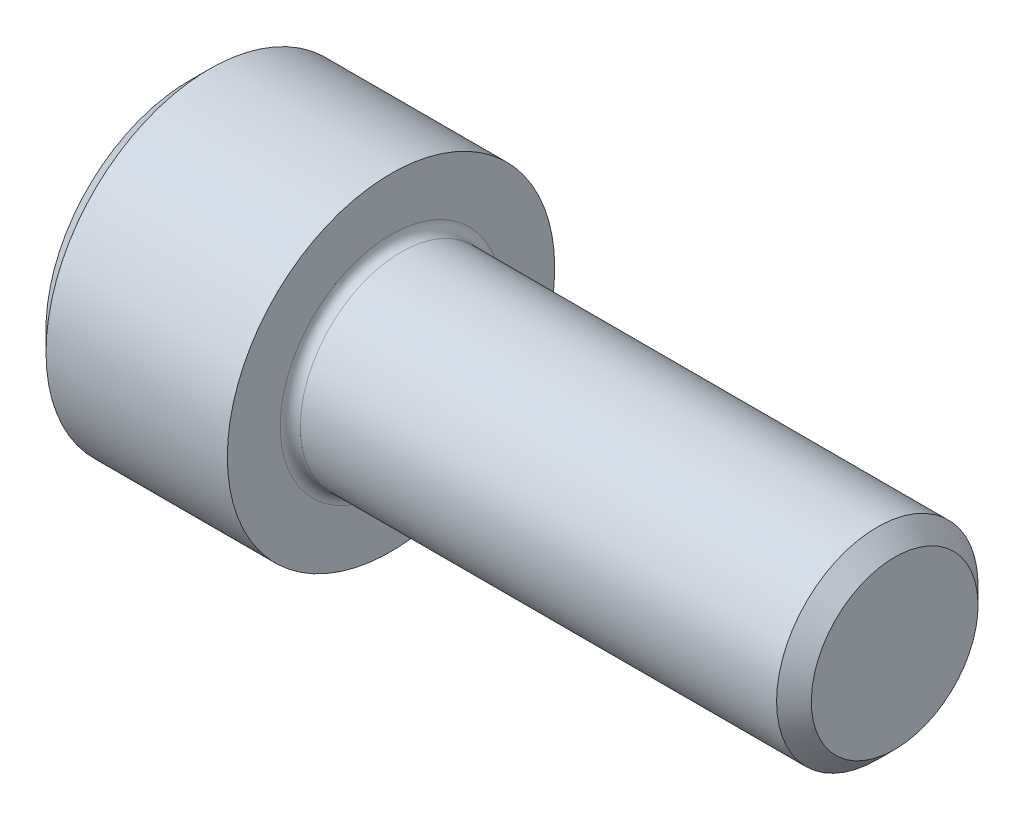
ISO-10303-21;
HEADER;
FILE_DESCRIPTION(('STEP AP214'),'2;1');
FILE_NAME('part.step','',(''),(''),'','','');
FILE_SCHEMA(('AUTOMOTIVE_DESIGN { 1 0 10303 214 1 1 1 1 }'));
ENDSEC;
DATA;
#1=APPLICATION_CONTEXT('core data for automotive mechanical design processes');
#2=APPLICATION_PROTOCOL_DEFINITION('international standard','automotive_design',2000,#1);
#3=PRODUCT_CONTEXT('',#1,'mechanical');
#4=PRODUCT('Part','Part','',(#3));
#5=PRODUCT_RELATED_PRODUCT_CATEGORY('part','',(#4));
#6=PRODUCT_DEFINITION_FORMATION('','',#4);
#7=PRODUCT_DEFINITION_CONTEXT('part definition',#1,'design');
#8=PRODUCT_DEFINITION('design','',#6,#7);
#9=PRODUCT_DEFINITION_SHAPE('','',#8);
#10=(LENGTH_UNIT() NAMED_UNIT(*) SI_UNIT(.MILLI.,.METRE.));
#11=(NAMED_UNIT(*) PLANE_ANGLE_UNIT() SI_UNIT($,.RADIAN.));
#12=(NAMED_UNIT(*) SI_UNIT($,.STERADIAN.) SOLID_ANGLE_UNIT());
#13=UNCERTAINTY_MEASURE_WITH_UNIT(LENGTH_MEASURE(1.E-05),#10,'distance_accuracy_value','');
#14=(GEOMETRIC_REPRESENTATION_CONTEXT(3) GLOBAL_UNCERTAINTY_ASSIGNED_CONTEXT((#13)) GLOBAL_UNIT_ASSIGNED_CONTEXT((#10,
#11,#12)) REPRESENTATION_CONTEXT('',''));
#15=CARTESIAN_POINT('',(0.,0.,0.));
#16=DIRECTION('',(0.,0.,1.));
#17=DIRECTION('',(1.,0.,0.));
#18=AXIS2_PLACEMENT_3D('',#15,#16,#17);
#19=CARTESIAN_POINT('',(28.,-3.349214,3.349214));
#20=DIRECTION('',(1.,0.,0.));
#21=DIRECTION('',(0.,0.,-1.));
#22=AXIS2_PLACEMENT_3D('',#19,#20,#21);
#23=PLANE('',#22);
#24=CARTESIAN_POINT('',(28.,0.,0.));
#25=DIRECTION('',(-1.,0.,0.));
#26=DIRECTION('',(0.,-1.,0.));
#27=AXIS2_PLACEMENT_3D('',#24,#25,#26);
#28=CIRCLE('',#27,3.30949999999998);
#29=CARTESIAN_POINT('',(28.,-3.30949999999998,0.));
#30=VERTEX_POINT('',#29);
#31=EDGE_CURVE('E21',#30,#30,#28,.F.);
#32=ORIENTED_EDGE('',*,*,#31,.T.);
#33=EDGE_LOOP('',(#32));
#34=FACE_BOUND('',#33,.T.);
#35=ADVANCED_FACE('F17',(#34),#23,.T.);
#36=CARTESIAN_POINT('',(28.,0.,0.));
#37=DIRECTION('',(-1.,0.,0.));
#38=DIRECTION('',(0.,-1.,0.));
#39=AXIS2_PLACEMENT_3D('',#36,#37,#38);
#40=CONICAL_SURFACE('',#39,3.3095,0.785398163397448);
#41=CARTESIAN_POINT('',(27.3095,0.,0.));
#42=DIRECTION('',(-1.,0.,0.));
#43=DIRECTION('',(0.,0.,1.));
#44=AXIS2_PLACEMENT_3D('',#41,#42,#43);
#45=CIRCLE('',#44,4.);
#46=CARTESIAN_POINT('',(27.3095,0.,4.));
#47=VERTEX_POINT('',#46);
#48=EDGE_CURVE('E125',#47,#47,#45,.F.);
#49=ORIENTED_EDGE('',*,*,#48,.T.);
#50=EDGE_LOOP('',(#49));
#51=FACE_BOUND('',#50,.T.);
#52=ORIENTED_EDGE('',*,*,#31,.F.);
#53=EDGE_LOOP('',(#52));
#54=FACE_BOUND('',#53,.T.);
#55=ADVANCED_FACE('F255',(#51,#54),#40,.T.);
#56=CARTESIAN_POINT('',(27.3095,0.,0.));
#57=DIRECTION('',(-1.,0.,0.));
#58=DIRECTION('',(0.,-1.,0.));
#59=AXIS2_PLACEMENT_3D('',#56,#57,#58);
#60=CYLINDRICAL_SURFACE('',#59,4.);
#61=CARTESIAN_POINT('',(8.40000000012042,0.,0.));
#62=DIRECTION('',(1.,0.,0.));
#63=DIRECTION('',(0.,0.,-1.));
#64=AXIS2_PLACEMENT_3D('',#61,#62,#63);
#65=CIRCLE('',#64,4.00000000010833);
#66=CARTESIAN_POINT('',(8.40000000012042,0.,-4.00000000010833));
#67=VERTEX_POINT('',#66);
#68=EDGE_CURVE('E121',#67,#67,#65,.T.);
#69=ORIENTED_EDGE('',*,*,#68,.T.);
#70=EDGE_LOOP('',(#69));
#71=FACE_BOUND('',#70,.T.);
#72=ORIENTED_EDGE('',*,*,#48,.F.);
#73=EDGE_LOOP('',(#72));
#74=FACE_BOUND('',#73,.T.);
#75=ADVANCED_FACE('F251',(#71,#74),#60,.T.);
#76=CARTESIAN_POINT('',(8.40000000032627,0.,0.));
#77=DIRECTION('',(1.,0.,0.));
#78=DIRECTION('',(0.,0.,-1.));
#79=AXIS2_PLACEMENT_3D('',#76,#77,#78);
#80=TOROIDAL_SURFACE('',#79,4.40000000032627,0.400000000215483);
#81=ORIENTED_EDGE('',*,*,#68,.F.);
#82=EDGE_LOOP('',(#81));
#83=FACE_BOUND('',#82,.T.);
#84=CARTESIAN_POINT('',(8.00000000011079,0.,0.));
#85=DIRECTION('',(1.,0.,0.));
#86=DIRECTION('',(0.,0.,-1.));
#87=AXIS2_PLACEMENT_3D('',#84,#85,#86);
#88=CIRCLE('',#87,4.400000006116);
#89=CARTESIAN_POINT('',(8.00000000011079,0.,-4.400000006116));
#90=VERTEX_POINT('',#89);
#91=EDGE_CURVE('E119',#90,#90,#88,.F.);
#92=ORIENTED_EDGE('',*,*,#91,.F.);
#93=EDGE_LOOP('',(#92));
#94=FACE_BOUND('',#93,.T.);
#95=ADVANCED_FACE('F254',(#83,#94),#80,.F.);
#96=CARTESIAN_POINT('',(8.,-6.578,6.578));
#97=DIRECTION('',(1.,0.,0.));
#98=DIRECTION('',(0.,0.,-1.));
#99=AXIS2_PLACEMENT_3D('',#96,#97,#98);
#100=PLANE('',#99);
#101=ORIENTED_EDGE('',*,*,#91,.T.);
#102=EDGE_LOOP('',(#101));
#103=FACE_BOUND('',#102,.T.);
#104=CARTESIAN_POINT('',(8.,0.,0.));
#105=DIRECTION('',(-1.,0.,0.));
#106=DIRECTION('',(0.,0.,1.));
#107=AXIS2_PLACEMENT_3D('',#104,#105,#106);
#108=CIRCLE('',#107,6.5);
#109=CARTESIAN_POINT('',(8.,0.,6.5));
#110=VERTEX_POINT('',#109);
#111=EDGE_CURVE('E117',#110,#110,#108,.F.);
#112=ORIENTED_EDGE('',*,*,#111,.T.);
#113=EDGE_LOOP('',(#112));
#114=FACE_BOUND('',#113,.T.);
#115=ADVANCED_FACE('F249',(#103,#114),#100,.T.);
#116=CARTESIAN_POINT('',(8.,0.,0.));
#117=DIRECTION('',(-1.,0.,0.));
#118=DIRECTION('',(0.,0.,1.));
#119=AXIS2_PLACEMENT_3D('',#116,#117,#118);
#120=CYLINDRICAL_SURFACE('',#119,6.5);
#121=CARTESIAN_POINT('',(0.799999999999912,0.,0.));
#122=DIRECTION('',(1.,0.,0.));
#123=DIRECTION('',(0.,0.,-1.));
#124=AXIS2_PLACEMENT_3D('',#121,#122,#123);
#125=CIRCLE('',#124,6.5);
#126=CARTESIAN_POINT('',(0.8,0.,-6.5));
#127=VERTEX_POINT('',#126);
#128=EDGE_CURVE('E94',#127,#127,#125,.T.);
#129=ORIENTED_EDGE('',*,*,#128,.T.);
#130=EDGE_LOOP('',(#129));
#131=FACE_BOUND('',#130,.T.);
#132=ORIENTED_EDGE('',*,*,#111,.F.);
#133=EDGE_LOOP('',(#132));
#134=FACE_BOUND('',#133,.T.);
#135=ADVANCED_FACE('F245',(#131,#134),#120,.T.);
#136=CARTESIAN_POINT('',(0.,0.,0.));
#137=DIRECTION('',(1.,0.,0.));
#138=DIRECTION('',(0.,0.,-1.));
#139=AXIS2_PLACEMENT_3D('',#136,#137,#138);
#140=CONICAL_SURFACE('',#139,5.7,0.785398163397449);
#141=ORIENTED_EDGE('',*,*,#128,.F.);
#142=EDGE_LOOP('',(#141));
#143=FACE_BOUND('',#142,.T.);
#144=CARTESIAN_POINT('',(0.,0.,0.));
#145=DIRECTION('',(1.,0.,0.));
#146=DIRECTION('',(0.,0.,-1.));
#147=AXIS2_PLACEMENT_3D('',#144,#145,#146);
#148=CIRCLE('',#147,5.7);
#149=CARTESIAN_POINT('',(0.,0.,-5.7));
#150=VERTEX_POINT('',#149);
#151=EDGE_CURVE('E93',#150,#150,#148,.F.);
#152=ORIENTED_EDGE('',*,*,#151,.F.);
#153=EDGE_LOOP('',(#152));
#154=FACE_BOUND('',#153,.T.);
#155=ADVANCED_FACE('F242',(#143,#154),#140,.T.);
#156=CARTESIAN_POINT('',(0.,1.759474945,-3.0475));
#157=DIRECTION('',(0.,0.866025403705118,-0.500000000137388));
#158=DIRECTION('',(0.,0.500000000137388,0.866025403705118));
#159=AXIS2_PLACEMENT_3D('',#156,#157,#158);
#160=PLANE('',#159);
#161=DIRECTION('',(1.,0.,0.));
#162=VECTOR('',#161,1.);
#163=CARTESIAN_POINT('',(2.,1.759474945,-3.0475));
#164=LINE('',#163,#162);
#165=CARTESIAN_POINT('',(0.,1.75947494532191,-3.0475));
#166=VERTEX_POINT('',#165);
#167=CARTESIAN_POINT('',(4.,1.759474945,-3.0475));
#168=VERTEX_POINT('',#167);
#169=EDGE_CURVE('E160',#166,#168,#164,.T.);
#170=ORIENTED_EDGE('',*,*,#169,.T.);
#171=DIRECTION('',(0.,0.500000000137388,0.866025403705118));
#172=VECTOR('',#171,1.);
#173=CARTESIAN_POINT('',(4.,1.759474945,-3.0475));
#174=LINE('',#173,#172);
#175=CARTESIAN_POINT('',(4.,2.63921241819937,-1.52374999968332));
#176=VERTEX_POINT('',#175);
#177=EDGE_CURVE('E158',#168,#176,#174,.T.);
#178=ORIENTED_EDGE('',*,*,#177,.T.);
#179=DIRECTION('',(0.,0.500000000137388,0.866025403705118));
#180=VECTOR('',#179,1.);
#181=CARTESIAN_POINT('',(4.,1.759474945,-3.0475));
#182=LINE('',#181,#180);
#183=CARTESIAN_POINT('',(4.,3.518949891,0.));
#184=VERTEX_POINT('',#183);
#185=EDGE_CURVE('E88',#176,#184,#182,.T.);
#186=ORIENTED_EDGE('',*,*,#185,.T.);
#187=DIRECTION('',(1.,0.,0.));
#188=VECTOR('',#187,1.);
#189=CARTESIAN_POINT('',(2.,3.518949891,0.));
#190=LINE('',#189,#188);
#191=CARTESIAN_POINT('',(0.,3.5189498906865,-4.93629063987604E-11));
#192=VERTEX_POINT('',#191);
#193=EDGE_CURVE('E81',#192,#184,#190,.T.);
#194=ORIENTED_EDGE('',*,*,#193,.F.);
#195=DIRECTION('',(0.,0.499999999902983,0.866025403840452));
#196=VECTOR('',#195,1.);
#197=CARTESIAN_POINT('',(0.,1.759474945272,-3.047500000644));
#198=LINE('',#197,#196);
#199=EDGE_CURVE('E85',#166,#192,#198,.T.);
#200=ORIENTED_EDGE('',*,*,#199,.F.);
#201=EDGE_LOOP('',(#170,#178,#186,#194,#200));
#202=FACE_BOUND('',#201,.T.);
#203=ADVANCED_FACE('F84',(#202),#160,.F.);
#204=CARTESIAN_POINT('',(0.,1.759474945,3.0475));
#205=DIRECTION('',(0.,-0.866025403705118,-0.500000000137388));
#206=DIRECTION('',(0.,0.500000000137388,-0.866025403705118));
#207=AXIS2_PLACEMENT_3D('',#204,#205,#206);
#208=PLANE('',#207);
#209=DIRECTION('',(0.,0.500000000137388,-0.866025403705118));
#210=VECTOR('',#209,1.);
#211=CARTESIAN_POINT('',(4.,1.759474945,3.0475));
#212=LINE('',#211,#210);
#213=CARTESIAN_POINT('',(4.,2.63921241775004,1.52375000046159));
#214=VERTEX_POINT('',#213);
#215=CARTESIAN_POINT('',(4.,1.759474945,3.0475));
#216=VERTEX_POINT('',#215);
#217=EDGE_CURVE('E106',#214,#216,#212,.F.);
#218=ORIENTED_EDGE('',*,*,#217,.T.);
#219=DIRECTION('',(-1.,0.,0.));
#220=VECTOR('',#219,1.);
#221=CARTESIAN_POINT('',(2.,1.759474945,3.0475));
#222=LINE('',#221,#220);
#223=CARTESIAN_POINT('',(0.,1.75947494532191,3.0475));
#224=VERTEX_POINT('',#223);
#225=EDGE_CURVE('E111',#216,#224,#222,.T.);
#226=ORIENTED_EDGE('',*,*,#225,.T.);
#227=DIRECTION('',(0.,-0.499999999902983,0.866025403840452));
#228=VECTOR('',#227,1.);
#229=CARTESIAN_POINT('',(0.,3.518949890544,0.));
#230=LINE('',#229,#228);
#231=EDGE_CURVE('E101',#192,#224,#230,.T.);
#232=ORIENTED_EDGE('',*,*,#231,.F.);
#233=ORIENTED_EDGE('',*,*,#193,.T.);
#234=DIRECTION('',(0.,0.500000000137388,-0.866025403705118));
#235=VECTOR('',#234,1.);
#236=CARTESIAN_POINT('',(4.,1.759474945,3.0475));
#237=LINE('',#236,#235);
#238=EDGE_CURVE('E161',#184,#214,#237,.F.);
#239=ORIENTED_EDGE('',*,*,#238,.T.);
#240=EDGE_LOOP('',(#218,#226,#232,#233,#239));
#241=FACE_BOUND('',#240,.T.);
#242=ADVANCED_FACE('F109',(#241),#208,.T.);
#243=CARTESIAN_POINT('',(0.,-5.7684,-5.7684));
#244=DIRECTION('',(-1.,0.,0.));
#245=DIRECTION('',(0.,0.,1.));
#246=AXIS2_PLACEMENT_3D('',#243,#244,#245);
#247=PLANE('',#246);
#248=DIRECTION('',(0.,1.,0.));
#249=VECTOR('',#248,1.);
#250=CARTESIAN_POINT('',(0.,0.,-3.0475));
#251=LINE('',#250,#249);
#252=CARTESIAN_POINT('',(0.,-1.759474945,-3.0475));
#253=VERTEX_POINT('',#252);
#254=EDGE_CURVE('E105',#253,#166,#251,.T.);
#255=ORIENTED_EDGE('',*,*,#254,.T.);
#256=ORIENTED_EDGE('',*,*,#199,.T.);
#257=ORIENTED_EDGE('',*,*,#231,.T.);
#258=DIRECTION('',(0.,-1.,0.));
#259=VECTOR('',#258,1.);
#260=CARTESIAN_POINT('',(0.,0.,3.0475));
#261=LINE('',#260,#259);
#262=CARTESIAN_POINT('',(0.,-1.759474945,3.0475));
#263=VERTEX_POINT('',#262);
#264=EDGE_CURVE('E173',#224,#263,#261,.T.);
#265=ORIENTED_EDGE('',*,*,#264,.T.);
#266=DIRECTION('',(0.,0.500000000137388,0.866025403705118));
#267=VECTOR('',#266,1.);
#268=CARTESIAN_POINT('',(0.,-2.639212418,1.52375));
#269=LINE('',#268,#267);
#270=CARTESIAN_POINT('',(0.,-3.518949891,0.));
#271=VERTEX_POINT('',#270);
#272=EDGE_CURVE('E199',#271,#263,#269,.T.);
#273=ORIENTED_EDGE('',*,*,#272,.F.);
#274=DIRECTION('',(0.,-0.500000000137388,0.866025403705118));
#275=VECTOR('',#274,1.);
#276=CARTESIAN_POINT('',(0.,-2.639212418,-1.52375));
#277=LINE('',#276,#275);
#278=EDGE_CURVE('E179',#253,#271,#277,.T.);
#279=ORIENTED_EDGE('',*,*,#278,.F.);
#280=EDGE_LOOP('',(#255,#256,#257,#265,#273,#279));
#281=FACE_BOUND('',#280,.T.);
#282=ORIENTED_EDGE('',*,*,#151,.T.);
#283=EDGE_LOOP('',(#282));
#284=FACE_BOUND('',#283,.T.);
#285=ADVANCED_FACE('F98',(#281,#284),#247,.T.);
#286=CARTESIAN_POINT('',(4.,-0.015835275,3.0475));
#287=DIRECTION('',(1.,0.,0.));
#288=DIRECTION('',(0.,0.,-1.));
#289=AXIS2_PLACEMENT_3D('',#286,#287,#288);
#290=PLANE('',#289);
#291=ORIENTED_EDGE('',*,*,#217,.F.);
#292=CARTESIAN_POINT('',(4.,0.,0.));
#293=DIRECTION('',(-1.,0.,0.));
#294=DIRECTION('',(0.,0.,1.));
#295=AXIS2_PLACEMENT_3D('',#292,#293,#294);
#296=CIRCLE('',#295,3.0475);
#297=CARTESIAN_POINT('',(4.,-2.73646157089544E-10,3.0475));
#298=VERTEX_POINT('',#297);
#299=EDGE_CURVE('E154',#298,#214,#296,.T.);
#300=ORIENTED_EDGE('',*,*,#299,.F.);
#301=DIRECTION('',(0.,1.,0.));
#302=VECTOR('',#301,1.);
#303=CARTESIAN_POINT('',(4.,0.,3.0475));
#304=LINE('',#303,#302);
#305=EDGE_CURVE('E170',#298,#216,#304,.T.);
#306=ORIENTED_EDGE('',*,*,#305,.T.);
#307=EDGE_LOOP('',(#291,#300,#306));
#308=FACE_BOUND('',#307,.T.);
#309=ADVANCED_FACE('F175',(#308),#290,.F.);
#310=CARTESIAN_POINT('',(4.,2.633933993,1.542035));
#311=DIRECTION('',(1.,0.,0.));
#312=DIRECTION('',(0.,0.,-1.));
#313=AXIS2_PLACEMENT_3D('',#310,#311,#312);
#314=PLANE('',#313);
#315=ORIENTED_EDGE('',*,*,#185,.F.);
#316=CARTESIAN_POINT('',(4.,0.,0.));
#317=DIRECTION('',(-1.,0.,0.));
#318=DIRECTION('',(0.,0.,1.));
#319=AXIS2_PLACEMENT_3D('',#316,#317,#318);
#320=CIRCLE('',#319,3.0475);
#321=EDGE_CURVE('E151',#214,#176,#320,.T.);
#322=ORIENTED_EDGE('',*,*,#321,.F.);
#323=ORIENTED_EDGE('',*,*,#238,.F.);
#324=EDGE_LOOP('',(#315,#322,#323));
#325=FACE_BOUND('',#324,.T.);
#326=ADVANCED_FACE('F222',(#325),#314,.F.);
#327=CARTESIAN_POINT('',(4.,-0.015835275,-1.5146075));
#328=DIRECTION('',(1.,0.,0.));
#329=DIRECTION('',(0.,0.,-1.));
#330=AXIS2_PLACEMENT_3D('',#327,#328,#329);
#331=PLANE('',#330);
#332=DIRECTION('',(0.,-1.,0.));
#333=VECTOR('',#332,1.);
#334=CARTESIAN_POINT('',(4.,0.,-3.0475));
#335=LINE('',#334,#333);
#336=CARTESIAN_POINT('',(4.,-6.2505282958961E-10,-3.0475));
#337=VERTEX_POINT('',#336);
#338=EDGE_CURVE('E190',#168,#337,#335,.T.);
#339=ORIENTED_EDGE('',*,*,#338,.T.);
#340=CARTESIAN_POINT('',(4.,0.,0.));
#341=DIRECTION('',(-1.,0.,0.));
#342=DIRECTION('',(0.,0.,1.));
#343=AXIS2_PLACEMENT_3D('',#340,#341,#342);
#344=CIRCLE('',#343,3.0475);
#345=EDGE_CURVE('E149',#176,#337,#344,.T.);
#346=ORIENTED_EDGE('',*,*,#345,.F.);
#347=ORIENTED_EDGE('',*,*,#177,.F.);
#348=EDGE_LOOP('',(#339,#346,#347));
#349=FACE_BOUND('',#348,.T.);
#350=ADVANCED_FACE('F218',(#349),#331,.F.);
#351=CARTESIAN_POINT('',(0.,-1.759474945,-3.0475));
#352=DIRECTION('',(0.,0.,-1.));
#353=DIRECTION('',(0.,1.,0.));
#354=AXIS2_PLACEMENT_3D('',#351,#352,#353);
#355=PLANE('',#354);
#356=DIRECTION('',(-1.,0.,0.));
#357=VECTOR('',#356,1.);
#358=CARTESIAN_POINT('',(2.,-1.759474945,-3.0475));
#359=LINE('',#358,#357);
#360=CARTESIAN_POINT('',(4.,-1.759474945,-3.0475));
#361=VERTEX_POINT('',#360);
#362=EDGE_CURVE('E176',#361,#253,#359,.T.);
#363=ORIENTED_EDGE('',*,*,#362,.F.);
#364=DIRECTION('',(0.,1.,0.));
#365=VECTOR('',#364,1.);
#366=CARTESIAN_POINT('',(4.,-1.319606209,-3.0475));
#367=LINE('',#366,#365);
#368=EDGE_CURVE('E145',#361,#337,#367,.T.);
#369=ORIENTED_EDGE('',*,*,#368,.T.);
#370=ORIENTED_EDGE('',*,*,#338,.F.);
#371=ORIENTED_EDGE('',*,*,#169,.F.);
#372=ORIENTED_EDGE('',*,*,#254,.F.);
#373=EDGE_LOOP('',(#363,#369,#370,#371,#372));
#374=FACE_BOUND('',#373,.T.);
#375=ADVANCED_FACE('F213',(#374),#355,.F.);
#376=CARTESIAN_POINT('',(0.,-1.759474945,-3.0475));
#377=DIRECTION('',(0.,0.866025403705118,0.500000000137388));
#378=DIRECTION('',(0.,-0.500000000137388,0.866025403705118));
#379=AXIS2_PLACEMENT_3D('',#376,#377,#378);
#380=PLANE('',#379);
#381=DIRECTION('',(0.,-0.500000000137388,0.866025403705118));
#382=VECTOR('',#381,1.);
#383=CARTESIAN_POINT('',(4.,-1.759474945,-3.0475));
#384=LINE('',#383,#382);
#385=CARTESIAN_POINT('',(4.,-2.63921241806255,-1.5237499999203));
#386=VERTEX_POINT('',#385);
#387=EDGE_CURVE('E146',#386,#361,#384,.F.);
#388=ORIENTED_EDGE('',*,*,#387,.T.);
#389=ORIENTED_EDGE('',*,*,#362,.T.);
#390=ORIENTED_EDGE('',*,*,#278,.T.);
#391=DIRECTION('',(-1.,0.,0.));
#392=VECTOR('',#391,1.);
#393=CARTESIAN_POINT('',(2.,-3.518949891,0.));
#394=LINE('',#393,#392);
#395=CARTESIAN_POINT('',(4.,-3.518949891,0.));
#396=VERTEX_POINT('',#395);
#397=EDGE_CURVE('E157',#396,#271,#394,.T.);
#398=ORIENTED_EDGE('',*,*,#397,.F.);
#399=DIRECTION('',(0.,-0.500000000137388,0.866025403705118));
#400=VECTOR('',#399,1.);
#401=CARTESIAN_POINT('',(4.,-1.759474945,-3.0475));
#402=LINE('',#401,#400);
#403=EDGE_CURVE('E141',#396,#386,#402,.F.);
#404=ORIENTED_EDGE('',*,*,#403,.T.);
#405=EDGE_LOOP('',(#388,#389,#390,#398,#404));
#406=FACE_BOUND('',#405,.T.);
#407=ADVANCED_FACE('F298',(#406),#380,.T.);
#408=CARTESIAN_POINT('',(0.,1.759474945,3.0475));
#409=DIRECTION('',(0.,0.,1.));
#410=DIRECTION('',(0.,-1.,0.));
#411=AXIS2_PLACEMENT_3D('',#408,#409,#410);
#412=PLANE('',#411);
#413=ORIENTED_EDGE('',*,*,#225,.F.);
#414=ORIENTED_EDGE('',*,*,#305,.F.);
#415=DIRECTION('',(0.,-1.,0.));
#416=VECTOR('',#415,1.);
#417=CARTESIAN_POINT('',(4.,-1.319606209,3.0475));
#418=LINE('',#417,#416);
#419=CARTESIAN_POINT('',(4.,-1.759474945,3.0475));
#420=VERTEX_POINT('',#419);
#421=EDGE_CURVE('E140',#298,#420,#418,.T.);
#422=ORIENTED_EDGE('',*,*,#421,.T.);
#423=DIRECTION('',(1.,0.,0.));
#424=VECTOR('',#423,1.);
#425=CARTESIAN_POINT('',(2.,-1.759474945,3.0475));
#426=LINE('',#425,#424);
#427=EDGE_CURVE('E187',#263,#420,#426,.T.);
#428=ORIENTED_EDGE('',*,*,#427,.F.);
#429=ORIENTED_EDGE('',*,*,#264,.F.);
#430=EDGE_LOOP('',(#413,#414,#422,#428,#429));
#431=FACE_BOUND('',#430,.T.);
#432=ADVANCED_FACE('F168',(#431),#412,.F.);
#433=CARTESIAN_POINT('',(0.,-3.518949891,0.));
#434=DIRECTION('',(0.,0.866025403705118,-0.500000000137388));
#435=DIRECTION('',(0.,0.500000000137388,0.866025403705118));
#436=AXIS2_PLACEMENT_3D('',#433,#434,#435);
#437=PLANE('',#436);
#438=DIRECTION('',(0.,0.500000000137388,0.866025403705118));
#439=VECTOR('',#438,1.);
#440=CARTESIAN_POINT('',(4.,-3.518949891,0.));
#441=LINE('',#440,#439);
#442=CARTESIAN_POINT('',(4.,-2.63921241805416,1.52374999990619));
#443=VERTEX_POINT('',#442);
#444=EDGE_CURVE('E36',#443,#396,#441,.F.);
#445=ORIENTED_EDGE('',*,*,#444,.T.);
#446=ORIENTED_EDGE('',*,*,#397,.T.);
#447=ORIENTED_EDGE('',*,*,#272,.T.);
#448=ORIENTED_EDGE('',*,*,#427,.T.);
#449=DIRECTION('',(0.,0.500000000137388,0.866025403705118));
#450=VECTOR('',#449,1.);
#451=CARTESIAN_POINT('',(4.,-3.518949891,0.));
#452=LINE('',#451,#450);
#453=EDGE_CURVE('E137',#420,#443,#452,.F.);
#454=ORIENTED_EDGE('',*,*,#453,.T.);
#455=EDGE_LOOP('',(#445,#446,#447,#448,#454));
#456=FACE_BOUND('',#455,.T.);
#457=ADVANCED_FACE('F312',(#456),#437,.T.);
#458=CARTESIAN_POINT('',(4.,-2.655047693,-1.5146075));
#459=DIRECTION('',(1.,0.,0.));
#460=DIRECTION('',(0.,0.,-1.));
#461=AXIS2_PLACEMENT_3D('',#458,#459,#460);
#462=PLANE('',#461);
#463=ORIENTED_EDGE('',*,*,#387,.F.);
#464=CARTESIAN_POINT('',(4.,0.,0.));
#465=DIRECTION('',(-1.,0.,0.));
#466=DIRECTION('',(0.,0.,1.));
#467=AXIS2_PLACEMENT_3D('',#464,#465,#466);
#468=CIRCLE('',#467,3.0475);
#469=EDGE_CURVE('E134',#337,#386,#468,.T.);
#470=ORIENTED_EDGE('',*,*,#469,.F.);
#471=ORIENTED_EDGE('',*,*,#368,.F.);
#472=EDGE_LOOP('',(#463,#470,#471));
#473=FACE_BOUND('',#472,.T.);
#474=ADVANCED_FACE('F319',(#473),#462,.F.);
#475=CARTESIAN_POINT('',(4.,-3.524228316,1.542035));
#476=DIRECTION('',(1.,0.,0.));
#477=DIRECTION('',(0.,0.,-1.));
#478=AXIS2_PLACEMENT_3D('',#475,#476,#477);
#479=PLANE('',#478);
#480=ORIENTED_EDGE('',*,*,#444,.F.);
#481=CARTESIAN_POINT('',(4.,0.,0.));
#482=DIRECTION('',(-1.,0.,0.));
#483=DIRECTION('',(0.,0.,1.));
#484=AXIS2_PLACEMENT_3D('',#481,#482,#483);
#485=CIRCLE('',#484,3.0475);
#486=EDGE_CURVE('E27',#386,#443,#485,.T.);
#487=ORIENTED_EDGE('',*,*,#486,.F.);
#488=ORIENTED_EDGE('',*,*,#403,.F.);
#489=EDGE_LOOP('',(#480,#487,#488));
#490=FACE_BOUND('',#489,.T.);
#491=ADVANCED_FACE('F238',(#490),#479,.F.);
#492=CARTESIAN_POINT('',(4.,-2.655047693,3.0475));
#493=DIRECTION('',(1.,0.,0.));
#494=DIRECTION('',(0.,0.,-1.));
#495=AXIS2_PLACEMENT_3D('',#492,#493,#494);
#496=PLANE('',#495);
#497=ORIENTED_EDGE('',*,*,#421,.F.);
#498=CARTESIAN_POINT('',(4.,0.,0.));
#499=DIRECTION('',(-1.,0.,0.));
#500=DIRECTION('',(0.,0.,1.));
#501=AXIS2_PLACEMENT_3D('',#498,#499,#500);
#502=CIRCLE('',#501,3.0475);
#503=EDGE_CURVE('E11',#443,#298,#502,.T.);
#504=ORIENTED_EDGE('',*,*,#503,.F.);
#505=ORIENTED_EDGE('',*,*,#453,.F.);
#506=EDGE_LOOP('',(#497,#504,#505));
#507=FACE_BOUND('',#506,.T.);
#508=ADVANCED_FACE('F19',(#507),#496,.F.);
#509=CARTESIAN_POINT('',(5.759474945,0.,0.));
#510=DIRECTION('',(-1.,0.,0.));
#511=DIRECTION('',(0.,0.,1.));
#512=AXIS2_PLACEMENT_3D('',#509,#510,#511);
#513=CONICAL_SURFACE('',#512,0.,1.04719755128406);
#514=CARTESIAN_POINT('',(5.759474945,0.,0.));
#515=VERTEX_POINT('',#514);
#516=VERTEX_LOOP('',#515);
#517=FACE_BOUND('',#516,.T.);
#518=ORIENTED_EDGE('',*,*,#486,.T.);
#519=ORIENTED_EDGE('',*,*,#503,.T.);
#520=ORIENTED_EDGE('',*,*,#299,.T.);
#521=ORIENTED_EDGE('',*,*,#321,.T.);
#522=ORIENTED_EDGE('',*,*,#345,.T.);
#523=ORIENTED_EDGE('',*,*,#469,.T.);
#524=EDGE_LOOP('',(#518,#519,#520,#521,#522,#523));
#525=FACE_BOUND('',#524,.T.);
#526=ADVANCED_FACE('F220',(#517,#525),#513,.F.);
#527=CLOSED_SHELL('',(#35,#55,#75,#95,#115,#135,#155,#203,#242,#285,#309,#326,#350,#375,#407,
#432,#457,#474,#491,#508,#526));
#528=MANIFOLD_SOLID_BREP('B1',#527);
#529=ADVANCED_BREP_SHAPE_REPRESENTATION('',(#18,#528),#14);
#530=SHAPE_DEFINITION_REPRESENTATION(#9,#529);
ENDSEC;
END-ISO-10303-21;
